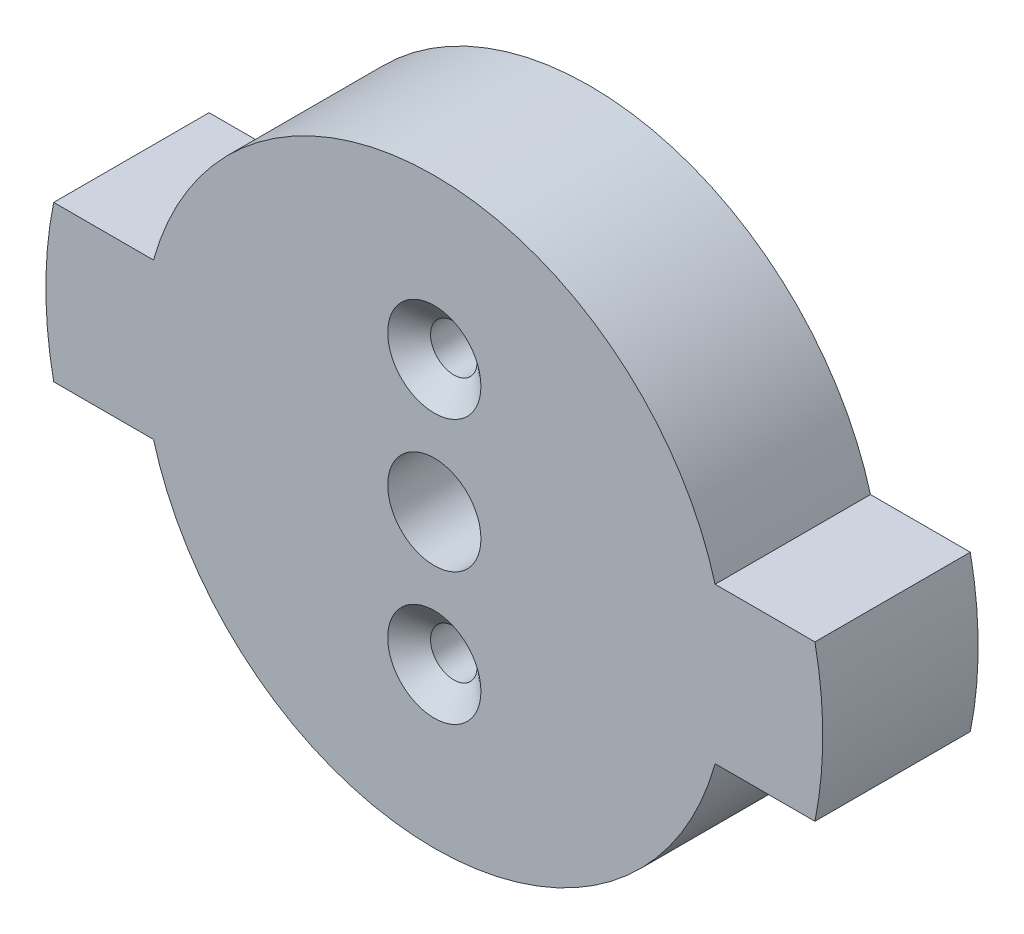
ISO-10303-21;
HEADER;
FILE_DESCRIPTION(('STEP AP214'),'2;1');
FILE_NAME('part.step','',(''),(''),'','','');
FILE_SCHEMA(('AUTOMOTIVE_DESIGN { 1 0 10303 214 1 1 1 1 }'));
ENDSEC;
DATA;
#1=APPLICATION_CONTEXT('core data for automotive mechanical design processes');
#2=APPLICATION_PROTOCOL_DEFINITION('international standard','automotive_design',2000,#1);
#3=PRODUCT_CONTEXT('',#1,'mechanical');
#4=PRODUCT('Part','Part','',(#3));
#5=PRODUCT_RELATED_PRODUCT_CATEGORY('part','',(#4));
#6=PRODUCT_DEFINITION_FORMATION('','',#4);
#7=PRODUCT_DEFINITION_CONTEXT('part definition',#1,'design');
#8=PRODUCT_DEFINITION('design','',#6,#7);
#9=PRODUCT_DEFINITION_SHAPE('','',#8);
#10=(LENGTH_UNIT() NAMED_UNIT(*) SI_UNIT(.MILLI.,.METRE.));
#11=(NAMED_UNIT(*) PLANE_ANGLE_UNIT() SI_UNIT($,.RADIAN.));
#12=(NAMED_UNIT(*) SI_UNIT($,.STERADIAN.) SOLID_ANGLE_UNIT());
#13=UNCERTAINTY_MEASURE_WITH_UNIT(LENGTH_MEASURE(1.E-05),#10,'distance_accuracy_value','');
#14=(GEOMETRIC_REPRESENTATION_CONTEXT(3) GLOBAL_UNCERTAINTY_ASSIGNED_CONTEXT((#13)) GLOBAL_UNIT_ASSIGNED_CONTEXT((#10,
#11,#12)) REPRESENTATION_CONTEXT('',''));
#15=CARTESIAN_POINT('',(0.,0.,0.));
#16=DIRECTION('',(0.,0.,1.));
#17=DIRECTION('',(1.,0.,0.));
#18=AXIS2_PLACEMENT_3D('',#15,#16,#17);
#19=CARTESIAN_POINT('',(0.,0.,5.08));
#20=DIRECTION('',(0.,0.,-1.));
#21=DIRECTION('',(-1.,0.,0.));
#22=AXIS2_PLACEMENT_3D('',#19,#20,#21);
#23=CYLINDRICAL_SURFACE('',#22,9.525);
#24=CARTESIAN_POINT('',(0.,0.,0.));
#25=DIRECTION('',(0.,0.,1.));
#26=DIRECTION('',(1.,0.,0.));
#27=AXIS2_PLACEMENT_3D('',#24,#25,#26);
#28=CIRCLE('',#27,9.525);
#29=CARTESIAN_POINT('',(9.18008850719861,2.54,0.));
#30=VERTEX_POINT('',#29);
#31=CARTESIAN_POINT('',(-9.18008850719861,2.54,0.));
#32=VERTEX_POINT('',#31);
#33=EDGE_CURVE('E108',#30,#32,#28,.T.);
#34=ORIENTED_EDGE('',*,*,#33,.T.);
#35=DIRECTION('',(0.,0.,1.));
#36=VECTOR('',#35,1.);
#37=CARTESIAN_POINT('',(-9.18008850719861,2.54,-6.18030556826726));
#38=LINE('',#37,#36);
#39=CARTESIAN_POINT('',(-9.18008850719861,2.54,5.08));
#40=VERTEX_POINT('',#39);
#41=EDGE_CURVE('E59',#32,#40,#38,.T.);
#42=ORIENTED_EDGE('',*,*,#41,.T.);
#43=CARTESIAN_POINT('',(0.,0.,5.08));
#44=DIRECTION('',(0.,0.,1.));
#45=DIRECTION('',(1.,0.,0.));
#46=AXIS2_PLACEMENT_3D('',#43,#44,#45);
#47=CIRCLE('',#46,9.525);
#48=CARTESIAN_POINT('',(9.18008850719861,2.54,5.08));
#49=VERTEX_POINT('',#48);
#50=EDGE_CURVE('E11',#49,#40,#47,.T.);
#51=ORIENTED_EDGE('',*,*,#50,.F.);
#52=DIRECTION('',(0.,0.,1.));
#53=VECTOR('',#52,1.);
#54=CARTESIAN_POINT('',(9.18008850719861,2.54,-6.18030556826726));
#55=LINE('',#54,#53);
#56=EDGE_CURVE('E144',#30,#49,#55,.T.);
#57=ORIENTED_EDGE('',*,*,#56,.F.);
#58=EDGE_LOOP('',(#34,#42,#51,#57));
#59=FACE_BOUND('',#58,.T.);
#60=ADVANCED_FACE('F35',(#59),#23,.T.);
#61=CARTESIAN_POINT('',(-9.18008850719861,-2.54,5.08));
#62=VERTEX_POINT('',#61);
#63=CARTESIAN_POINT('',(9.18008850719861,-2.54,5.08));
#64=VERTEX_POINT('',#63);
#65=EDGE_CURVE('E44',#62,#64,#47,.T.);
#66=ORIENTED_EDGE('',*,*,#65,.F.);
#67=DIRECTION('',(0.,0.,1.));
#68=VECTOR('',#67,1.);
#69=CARTESIAN_POINT('',(-9.18008850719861,-2.54,-6.18030556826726));
#70=LINE('',#69,#68);
#71=CARTESIAN_POINT('',(-9.18008850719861,-2.54,0.));
#72=VERTEX_POINT('',#71);
#73=EDGE_CURVE('E110',#72,#62,#70,.T.);
#74=ORIENTED_EDGE('',*,*,#73,.F.);
#75=CARTESIAN_POINT('',(9.18008850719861,-2.54,0.));
#76=VERTEX_POINT('',#75);
#77=EDGE_CURVE('E100',#72,#76,#28,.T.);
#78=ORIENTED_EDGE('',*,*,#77,.T.);
#79=DIRECTION('',(0.,0.,1.));
#80=VECTOR('',#79,1.);
#81=CARTESIAN_POINT('',(9.18008850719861,-2.54,-6.18030556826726));
#82=LINE('',#81,#80);
#83=EDGE_CURVE('E143',#76,#64,#82,.T.);
#84=ORIENTED_EDGE('',*,*,#83,.T.);
#85=EDGE_LOOP('',(#66,#74,#78,#84));
#86=FACE_BOUND('',#85,.T.);
#87=ADVANCED_FACE('F37',(#86),#23,.T.);
#88=CARTESIAN_POINT('',(0.,0.,0.));
#89=DIRECTION('',(0.,0.,1.));
#90=DIRECTION('',(1.,0.,0.));
#91=AXIS2_PLACEMENT_3D('',#88,#89,#90);
#92=CYLINDRICAL_SURFACE('',#91,1.524);
#93=CARTESIAN_POINT('',(0.,0.,5.08));
#94=DIRECTION('',(0.,0.,1.));
#95=DIRECTION('',(1.,0.,0.));
#96=AXIS2_PLACEMENT_3D('',#93,#94,#95);
#97=CIRCLE('',#96,1.524);
#98=CARTESIAN_POINT('',(1.524,0.,5.08));
#99=VERTEX_POINT('',#98);
#100=EDGE_CURVE('E109',#99,#99,#97,.T.);
#101=ORIENTED_EDGE('',*,*,#100,.T.);
#102=EDGE_LOOP('',(#101));
#103=FACE_BOUND('',#102,.T.);
#104=CARTESIAN_POINT('',(0.,0.,1.27));
#105=DIRECTION('',(0.,0.,-1.));
#106=DIRECTION('',(-1.,0.,0.));
#107=AXIS2_PLACEMENT_3D('',#104,#105,#106);
#108=CIRCLE('',#107,1.524);
#109=CARTESIAN_POINT('',(-1.524,0.,1.27));
#110=VERTEX_POINT('',#109);
#111=EDGE_CURVE('E39',#110,#110,#108,.F.);
#112=ORIENTED_EDGE('',*,*,#111,.F.);
#113=EDGE_LOOP('',(#112));
#114=FACE_BOUND('',#113,.T.);
#115=ADVANCED_FACE('F200',(#103,#114),#92,.F.);
#116=CARTESIAN_POINT('',(0.,0.,5.08));
#117=DIRECTION('',(0.,0.,1.));
#118=DIRECTION('',(1.,0.,0.));
#119=AXIS2_PLACEMENT_3D('',#116,#117,#118);
#120=PLANE('',#119);
#121=CARTESIAN_POINT('',(0.,-4.318,5.08));
#122=DIRECTION('',(0.,0.,1.));
#123=DIRECTION('',(1.,0.,0.));
#124=AXIS2_PLACEMENT_3D('',#121,#122,#123);
#125=CIRCLE('',#124,1.524);
#126=CARTESIAN_POINT('',(1.524,-4.318,5.08));
#127=VERTEX_POINT('',#126);
#128=EDGE_CURVE('E158',#127,#127,#125,.T.);
#129=ORIENTED_EDGE('',*,*,#128,.F.);
#130=EDGE_LOOP('',(#129));
#131=FACE_BOUND('',#130,.T.);
#132=CARTESIAN_POINT('',(0.,4.318,5.08));
#133=DIRECTION('',(0.,0.,1.));
#134=DIRECTION('',(1.,0.,0.));
#135=AXIS2_PLACEMENT_3D('',#132,#133,#134);
#136=CIRCLE('',#135,1.524);
#137=CARTESIAN_POINT('',(1.524,4.318,5.08));
#138=VERTEX_POINT('',#137);
#139=EDGE_CURVE('E167',#138,#138,#136,.T.);
#140=ORIENTED_EDGE('',*,*,#139,.F.);
#141=EDGE_LOOP('',(#140));
#142=FACE_BOUND('',#141,.T.);
#143=ORIENTED_EDGE('',*,*,#100,.F.);
#144=EDGE_LOOP('',(#143));
#145=FACE_BOUND('',#144,.T.);
#146=ORIENTED_EDGE('',*,*,#50,.T.);
#147=DIRECTION('',(-1.,0.,0.));
#148=VECTOR('',#147,1.);
#149=CARTESIAN_POINT('',(-9.18008850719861,2.54,5.08));
#150=LINE('',#149,#148);
#151=CARTESIAN_POINT('',(-12.4434078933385,2.54,5.08));
#152=VERTEX_POINT('',#151);
#153=EDGE_CURVE('E137',#40,#152,#150,.T.);
#154=ORIENTED_EDGE('',*,*,#153,.T.);
#155=CARTESIAN_POINT('',(0.,0.,5.08));
#156=DIRECTION('',(0.,0.,1.));
#157=DIRECTION('',(1.,0.,0.));
#158=AXIS2_PLACEMENT_3D('',#155,#156,#157);
#159=CIRCLE('',#158,12.7);
#160=CARTESIAN_POINT('',(-12.4434078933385,-2.54,5.08));
#161=VERTEX_POINT('',#160);
#162=EDGE_CURVE('E277',#152,#161,#159,.T.);
#163=ORIENTED_EDGE('',*,*,#162,.T.);
#164=DIRECTION('',(1.,0.,0.));
#165=VECTOR('',#164,1.);
#166=CARTESIAN_POINT('',(-12.4434078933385,-2.54,5.08));
#167=LINE('',#166,#165);
#168=EDGE_CURVE('E183',#161,#62,#167,.T.);
#169=ORIENTED_EDGE('',*,*,#168,.T.);
#170=ORIENTED_EDGE('',*,*,#65,.T.);
#171=DIRECTION('',(-1.,0.,0.));
#172=VECTOR('',#171,1.);
#173=CARTESIAN_POINT('',(12.4434078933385,-2.54,5.08));
#174=LINE('',#173,#172);
#175=CARTESIAN_POINT('',(12.4434078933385,-2.54,5.08));
#176=VERTEX_POINT('',#175);
#177=EDGE_CURVE('E133',#176,#64,#174,.T.);
#178=ORIENTED_EDGE('',*,*,#177,.F.);
#179=CARTESIAN_POINT('',(0.,0.,5.08));
#180=DIRECTION('',(0.,0.,-1.));
#181=DIRECTION('',(-1.,0.,0.));
#182=AXIS2_PLACEMENT_3D('',#179,#180,#181);
#183=CIRCLE('',#182,12.7);
#184=CARTESIAN_POINT('',(12.4434078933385,2.54,5.08));
#185=VERTEX_POINT('',#184);
#186=EDGE_CURVE('E136',#185,#176,#183,.T.);
#187=ORIENTED_EDGE('',*,*,#186,.F.);
#188=DIRECTION('',(1.,0.,0.));
#189=VECTOR('',#188,1.);
#190=CARTESIAN_POINT('',(9.18008850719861,2.54,5.08));
#191=LINE('',#190,#189);
#192=EDGE_CURVE('E140',#49,#185,#191,.T.);
#193=ORIENTED_EDGE('',*,*,#192,.F.);
#194=EDGE_LOOP('',(#146,#154,#163,#169,#170,#178,#187,#193));
#195=FACE_BOUND('',#194,.T.);
#196=ADVANCED_FACE('F180',(#131,#142,#145,#195),#120,.T.);
#197=CARTESIAN_POINT('',(0.,0.,0.));
#198=DIRECTION('',(0.,0.,1.));
#199=DIRECTION('',(1.,0.,0.));
#200=AXIS2_PLACEMENT_3D('',#197,#198,#199);
#201=PLANE('',#200);
#202=CARTESIAN_POINT('',(0.,0.,0.));
#203=DIRECTION('',(0.,0.,-1.));
#204=DIRECTION('',(-1.,0.,0.));
#205=AXIS2_PLACEMENT_3D('',#202,#203,#204);
#206=CIRCLE('',#205,2.54);
#207=CARTESIAN_POINT('',(-2.54,0.,0.));
#208=VERTEX_POINT('',#207);
#209=EDGE_CURVE('E132',#208,#208,#206,.T.);
#210=ORIENTED_EDGE('',*,*,#209,.F.);
#211=EDGE_LOOP('',(#210));
#212=FACE_BOUND('',#211,.T.);
#213=CARTESIAN_POINT('',(0.,-4.318,0.));
#214=DIRECTION('',(0.,0.,1.));
#215=DIRECTION('',(1.,0.,0.));
#216=AXIS2_PLACEMENT_3D('',#213,#214,#215);
#217=CIRCLE('',#216,0.761999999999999);
#218=CARTESIAN_POINT('',(0.762000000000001,-4.318,0.));
#219=VERTEX_POINT('',#218);
#220=EDGE_CURVE('E164',#219,#219,#217,.T.);
#221=ORIENTED_EDGE('',*,*,#220,.T.);
#222=EDGE_LOOP('',(#221));
#223=FACE_BOUND('',#222,.T.);
#224=CARTESIAN_POINT('',(0.,4.318,0.));
#225=DIRECTION('',(0.,0.,1.));
#226=DIRECTION('',(1.,0.,0.));
#227=AXIS2_PLACEMENT_3D('',#224,#225,#226);
#228=CIRCLE('',#227,0.761999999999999);
#229=CARTESIAN_POINT('',(0.761999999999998,4.318,0.));
#230=VERTEX_POINT('',#229);
#231=EDGE_CURVE('E173',#230,#230,#228,.T.);
#232=ORIENTED_EDGE('',*,*,#231,.T.);
#233=EDGE_LOOP('',(#232));
#234=FACE_BOUND('',#233,.T.);
#235=ORIENTED_EDGE('',*,*,#33,.F.);
#236=DIRECTION('',(-1.,0.,0.));
#237=VECTOR('',#236,1.);
#238=CARTESIAN_POINT('',(9.18008850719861,2.54,0.));
#239=LINE('',#238,#237);
#240=CARTESIAN_POINT('',(12.4434078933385,2.54,0.));
#241=VERTEX_POINT('',#240);
#242=EDGE_CURVE('E129',#241,#30,#239,.T.);
#243=ORIENTED_EDGE('',*,*,#242,.F.);
#244=CARTESIAN_POINT('',(0.,0.,0.));
#245=DIRECTION('',(0.,0.,1.));
#246=DIRECTION('',(1.,0.,0.));
#247=AXIS2_PLACEMENT_3D('',#244,#245,#246);
#248=CIRCLE('',#247,12.7);
#249=CARTESIAN_POINT('',(12.4434078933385,-2.54,0.));
#250=VERTEX_POINT('',#249);
#251=EDGE_CURVE('E126',#250,#241,#248,.T.);
#252=ORIENTED_EDGE('',*,*,#251,.F.);
#253=DIRECTION('',(1.,0.,0.));
#254=VECTOR('',#253,1.);
#255=CARTESIAN_POINT('',(12.4434078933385,-2.54,0.));
#256=LINE('',#255,#254);
#257=EDGE_CURVE('E106',#76,#250,#256,.T.);
#258=ORIENTED_EDGE('',*,*,#257,.F.);
#259=ORIENTED_EDGE('',*,*,#77,.F.);
#260=DIRECTION('',(-1.,0.,0.));
#261=VECTOR('',#260,1.);
#262=CARTESIAN_POINT('',(-12.4434078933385,-2.54,0.));
#263=LINE('',#262,#261);
#264=CARTESIAN_POINT('',(-12.4434078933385,-2.54,0.));
#265=VERTEX_POINT('',#264);
#266=EDGE_CURVE('E103',#72,#265,#263,.T.);
#267=ORIENTED_EDGE('',*,*,#266,.T.);
#268=CARTESIAN_POINT('',(0.,0.,0.));
#269=DIRECTION('',(0.,0.,1.));
#270=DIRECTION('',(1.,0.,0.));
#271=AXIS2_PLACEMENT_3D('',#268,#269,#270);
#272=CIRCLE('',#271,12.7);
#273=CARTESIAN_POINT('',(-12.4434078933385,2.54,0.));
#274=VERTEX_POINT('',#273);
#275=EDGE_CURVE('E122',#265,#274,#272,.F.);
#276=ORIENTED_EDGE('',*,*,#275,.T.);
#277=DIRECTION('',(1.,0.,0.));
#278=VECTOR('',#277,1.);
#279=CARTESIAN_POINT('',(-9.18008850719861,2.54,0.));
#280=LINE('',#279,#278);
#281=EDGE_CURVE('E118',#274,#32,#280,.T.);
#282=ORIENTED_EDGE('',*,*,#281,.T.);
#283=EDGE_LOOP('',(#235,#243,#252,#258,#259,#267,#276,#282));
#284=FACE_BOUND('',#283,.T.);
#285=ADVANCED_FACE('F101',(#212,#223,#234,#284),#201,.F.);
#286=CARTESIAN_POINT('',(0.,4.318,5.08));
#287=DIRECTION('',(0.,0.,1.));
#288=DIRECTION('',(1.,0.,0.));
#289=AXIS2_PLACEMENT_3D('',#286,#287,#288);
#290=CYLINDRICAL_SURFACE('',#289,0.762);
#291=ORIENTED_EDGE('',*,*,#231,.F.);
#292=EDGE_LOOP('',(#291));
#293=FACE_BOUND('',#292,.T.);
#294=CARTESIAN_POINT('',(0.,4.318,4.44060608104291));
#295=DIRECTION('',(0.,0.,1.));
#296=DIRECTION('',(1.,0.,0.));
#297=AXIS2_PLACEMENT_3D('',#294,#295,#296);
#298=CIRCLE('',#297,0.762);
#299=CARTESIAN_POINT('',(0.761999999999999,4.318,4.44060608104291));
#300=VERTEX_POINT('',#299);
#301=EDGE_CURVE('E170',#300,#300,#298,.T.);
#302=ORIENTED_EDGE('',*,*,#301,.T.);
#303=EDGE_LOOP('',(#302));
#304=FACE_BOUND('',#303,.T.);
#305=ADVANCED_FACE('F215',(#293,#304),#290,.F.);
#306=CARTESIAN_POINT('',(0.,4.318,5.08));
#307=DIRECTION('',(0.,0.,1.));
#308=DIRECTION('',(1.,0.,0.));
#309=AXIS2_PLACEMENT_3D('',#306,#307,#308);
#310=CONICAL_SURFACE('',#309,1.524,0.872664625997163);
#311=ORIENTED_EDGE('',*,*,#301,.F.);
#312=EDGE_LOOP('',(#311));
#313=FACE_BOUND('',#312,.T.);
#314=ORIENTED_EDGE('',*,*,#139,.T.);
#315=EDGE_LOOP('',(#314));
#316=FACE_BOUND('',#315,.T.);
#317=ADVANCED_FACE('F222',(#313,#316),#310,.F.);
#318=CARTESIAN_POINT('',(0.,-4.318,5.08));
#319=DIRECTION('',(0.,0.,1.));
#320=DIRECTION('',(1.,0.,0.));
#321=AXIS2_PLACEMENT_3D('',#318,#319,#320);
#322=CYLINDRICAL_SURFACE('',#321,0.762);
#323=ORIENTED_EDGE('',*,*,#220,.F.);
#324=EDGE_LOOP('',(#323));
#325=FACE_BOUND('',#324,.T.);
#326=CARTESIAN_POINT('',(0.,-4.318,4.44060608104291));
#327=DIRECTION('',(0.,0.,1.));
#328=DIRECTION('',(1.,0.,0.));
#329=AXIS2_PLACEMENT_3D('',#326,#327,#328);
#330=CIRCLE('',#329,0.762);
#331=CARTESIAN_POINT('',(0.762000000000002,-4.318,4.44060608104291));
#332=VERTEX_POINT('',#331);
#333=EDGE_CURVE('E161',#332,#332,#330,.T.);
#334=ORIENTED_EDGE('',*,*,#333,.T.);
#335=EDGE_LOOP('',(#334));
#336=FACE_BOUND('',#335,.T.);
#337=ADVANCED_FACE('F234',(#325,#336),#322,.F.);
#338=CARTESIAN_POINT('',(0.,-4.318,5.08));
#339=DIRECTION('',(0.,0.,1.));
#340=DIRECTION('',(1.,0.,0.));
#341=AXIS2_PLACEMENT_3D('',#338,#339,#340);
#342=CONICAL_SURFACE('',#341,1.524,0.872664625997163);
#343=ORIENTED_EDGE('',*,*,#333,.F.);
#344=EDGE_LOOP('',(#343));
#345=FACE_BOUND('',#344,.T.);
#346=ORIENTED_EDGE('',*,*,#128,.T.);
#347=EDGE_LOOP('',(#346));
#348=FACE_BOUND('',#347,.T.);
#349=ADVANCED_FACE('F242',(#345,#348),#342,.F.);
#350=CARTESIAN_POINT('',(0.,0.,1.27));
#351=DIRECTION('',(0.,0.,-1.));
#352=DIRECTION('',(-1.,0.,0.));
#353=AXIS2_PLACEMENT_3D('',#350,#351,#352);
#354=PLANE('',#353);
#355=CARTESIAN_POINT('',(0.,0.,1.27));
#356=DIRECTION('',(0.,0.,-1.));
#357=DIRECTION('',(-1.,0.,0.));
#358=AXIS2_PLACEMENT_3D('',#355,#356,#357);
#359=CIRCLE('',#358,2.54);
#360=CARTESIAN_POINT('',(-2.54,0.,1.27));
#361=VERTEX_POINT('',#360);
#362=EDGE_CURVE('E153',#361,#361,#359,.T.);
#363=ORIENTED_EDGE('',*,*,#362,.T.);
#364=EDGE_LOOP('',(#363));
#365=FACE_BOUND('',#364,.T.);
#366=ORIENTED_EDGE('',*,*,#111,.T.);
#367=EDGE_LOOP('',(#366));
#368=FACE_BOUND('',#367,.T.);
#369=ADVANCED_FACE('F248',(#365,#368),#354,.T.);
#370=CARTESIAN_POINT('',(0.,0.,1.27));
#371=DIRECTION('',(0.,0.,-1.));
#372=DIRECTION('',(-1.,0.,0.));
#373=AXIS2_PLACEMENT_3D('',#370,#371,#372);
#374=CYLINDRICAL_SURFACE('',#373,2.54);
#375=ORIENTED_EDGE('',*,*,#362,.F.);
#376=EDGE_LOOP('',(#375));
#377=FACE_BOUND('',#376,.T.);
#378=ORIENTED_EDGE('',*,*,#209,.T.);
#379=EDGE_LOOP('',(#378));
#380=FACE_BOUND('',#379,.T.);
#381=ADVANCED_FACE('F250',(#377,#380),#374,.F.);
#382=CARTESIAN_POINT('',(12.4434078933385,-2.54,-6.18030556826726));
#383=DIRECTION('',(0.,1.,0.));
#384=DIRECTION('',(0.,0.,1.));
#385=AXIS2_PLACEMENT_3D('',#382,#383,#384);
#386=PLANE('',#385);
#387=ORIENTED_EDGE('',*,*,#83,.F.);
#388=ORIENTED_EDGE('',*,*,#257,.T.);
#389=DIRECTION('',(0.,0.,1.));
#390=VECTOR('',#389,1.);
#391=CARTESIAN_POINT('',(12.4434078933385,-2.54,-6.18030556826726));
#392=LINE('',#391,#390);
#393=EDGE_CURVE('E149',#250,#176,#392,.T.);
#394=ORIENTED_EDGE('',*,*,#393,.T.);
#395=ORIENTED_EDGE('',*,*,#177,.T.);
#396=EDGE_LOOP('',(#387,#388,#394,#395));
#397=FACE_BOUND('',#396,.T.);
#398=ADVANCED_FACE('F185',(#397),#386,.F.);
#399=CARTESIAN_POINT('',(0.,0.,-6.18030556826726));
#400=DIRECTION('',(0.,0.,1.));
#401=DIRECTION('',(1.,0.,0.));
#402=AXIS2_PLACEMENT_3D('',#399,#400,#401);
#403=CYLINDRICAL_SURFACE('',#402,12.7);
#404=ORIENTED_EDGE('',*,*,#393,.F.);
#405=ORIENTED_EDGE('',*,*,#251,.T.);
#406=DIRECTION('',(0.,0.,1.));
#407=VECTOR('',#406,1.);
#408=CARTESIAN_POINT('',(12.4434078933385,2.54,-6.18030556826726));
#409=LINE('',#408,#407);
#410=EDGE_CURVE('E147',#241,#185,#409,.T.);
#411=ORIENTED_EDGE('',*,*,#410,.T.);
#412=ORIENTED_EDGE('',*,*,#186,.T.);
#413=EDGE_LOOP('',(#404,#405,#411,#412));
#414=FACE_BOUND('',#413,.T.);
#415=ADVANCED_FACE('F188',(#414),#403,.T.);
#416=CARTESIAN_POINT('',(9.18008850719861,2.54,-6.18030556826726));
#417=DIRECTION('',(0.,-1.,0.));
#418=DIRECTION('',(0.,0.,-1.));
#419=AXIS2_PLACEMENT_3D('',#416,#417,#418);
#420=PLANE('',#419);
#421=ORIENTED_EDGE('',*,*,#410,.F.);
#422=ORIENTED_EDGE('',*,*,#242,.T.);
#423=ORIENTED_EDGE('',*,*,#56,.T.);
#424=ORIENTED_EDGE('',*,*,#192,.T.);
#425=EDGE_LOOP('',(#421,#422,#423,#424));
#426=FACE_BOUND('',#425,.T.);
#427=ADVANCED_FACE('F194',(#426),#420,.F.);
#428=CARTESIAN_POINT('',(-9.18008850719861,2.54,-6.18030556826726));
#429=DIRECTION('',(0.,1.,0.));
#430=DIRECTION('',(0.,0.,1.));
#431=AXIS2_PLACEMENT_3D('',#428,#429,#430);
#432=PLANE('',#431);
#433=ORIENTED_EDGE('',*,*,#281,.F.);
#434=DIRECTION('',(0.,0.,1.));
#435=VECTOR('',#434,1.);
#436=CARTESIAN_POINT('',(-12.4434078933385,2.54,-6.18030556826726));
#437=LINE('',#436,#435);
#438=EDGE_CURVE('E275',#274,#152,#437,.T.);
#439=ORIENTED_EDGE('',*,*,#438,.T.);
#440=ORIENTED_EDGE('',*,*,#153,.F.);
#441=ORIENTED_EDGE('',*,*,#41,.F.);
#442=EDGE_LOOP('',(#433,#439,#440,#441));
#443=FACE_BOUND('',#442,.T.);
#444=ADVANCED_FACE('F262',(#443),#432,.T.);
#445=CARTESIAN_POINT('',(-12.4434078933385,-2.54,-6.18030556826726));
#446=DIRECTION('',(0.,-1.,0.));
#447=DIRECTION('',(0.,0.,-1.));
#448=AXIS2_PLACEMENT_3D('',#445,#446,#447);
#449=PLANE('',#448);
#450=ORIENTED_EDGE('',*,*,#266,.F.);
#451=ORIENTED_EDGE('',*,*,#73,.T.);
#452=ORIENTED_EDGE('',*,*,#168,.F.);
#453=DIRECTION('',(0.,0.,1.));
#454=VECTOR('',#453,1.);
#455=CARTESIAN_POINT('',(-12.4434078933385,-2.54,-6.18030556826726));
#456=LINE('',#455,#454);
#457=EDGE_CURVE('E114',#265,#161,#456,.T.);
#458=ORIENTED_EDGE('',*,*,#457,.F.);
#459=EDGE_LOOP('',(#450,#451,#452,#458));
#460=FACE_BOUND('',#459,.T.);
#461=ADVANCED_FACE('F116',(#460),#449,.T.);
#462=CARTESIAN_POINT('',(0.,0.,-6.18030556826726));
#463=DIRECTION('',(0.,0.,1.));
#464=DIRECTION('',(1.,0.,0.));
#465=AXIS2_PLACEMENT_3D('',#462,#463,#464);
#466=CYLINDRICAL_SURFACE('',#465,12.7);
#467=ORIENTED_EDGE('',*,*,#275,.F.);
#468=ORIENTED_EDGE('',*,*,#457,.T.);
#469=ORIENTED_EDGE('',*,*,#162,.F.);
#470=ORIENTED_EDGE('',*,*,#438,.F.);
#471=EDGE_LOOP('',(#467,#468,#469,#470));
#472=FACE_BOUND('',#471,.T.);
#473=ADVANCED_FACE('F265',(#472),#466,.T.);
#474=CLOSED_SHELL('',(#60,#87,#115,#196,#285,#305,#317,#337,#349,#369,#381,#398,#415,#427,#444,
#461,#473));
#475=MANIFOLD_SOLID_BREP('B2',#474);
#476=ADVANCED_BREP_SHAPE_REPRESENTATION('',(#18,#475),#14);
#477=SHAPE_DEFINITION_REPRESENTATION(#9,#476);
ENDSEC;
END-ISO-10303-21;
